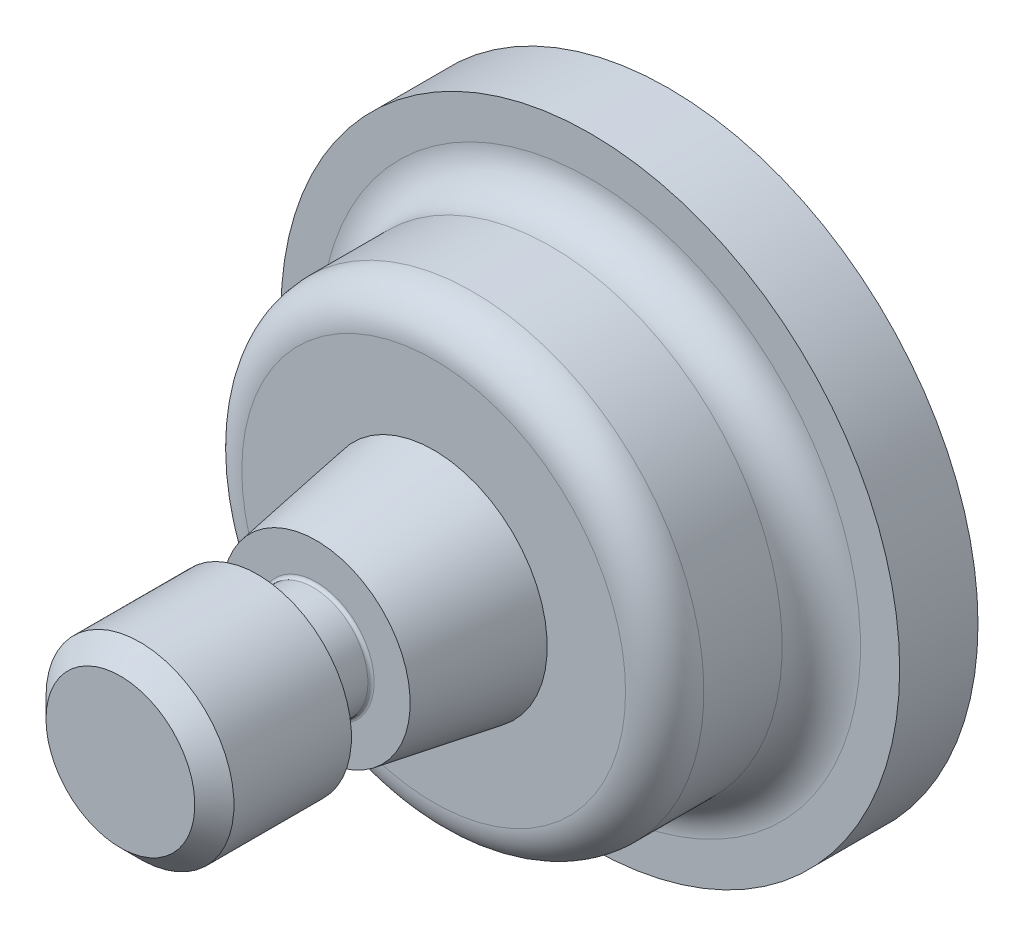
ISO-10303-21;
HEADER;
FILE_DESCRIPTION(('STEP AP214'),'2;1');
FILE_NAME('part.step','',(''),(''),'','','');
FILE_SCHEMA(('AUTOMOTIVE_DESIGN { 1 0 10303 214 1 1 1 1 }'));
ENDSEC;
DATA;
#1=APPLICATION_CONTEXT('core data for automotive mechanical design processes');
#2=APPLICATION_PROTOCOL_DEFINITION('international standard','automotive_design',2000,#1);
#3=PRODUCT_CONTEXT('',#1,'mechanical');
#4=PRODUCT('Part','Part','',(#3));
#5=PRODUCT_RELATED_PRODUCT_CATEGORY('part','',(#4));
#6=PRODUCT_DEFINITION_FORMATION('','',#4);
#7=PRODUCT_DEFINITION_CONTEXT('part definition',#1,'design');
#8=PRODUCT_DEFINITION('design','',#6,#7);
#9=PRODUCT_DEFINITION_SHAPE('','',#8);
#10=(LENGTH_UNIT() NAMED_UNIT(*) SI_UNIT(.MILLI.,.METRE.));
#11=(NAMED_UNIT(*) PLANE_ANGLE_UNIT() SI_UNIT($,.RADIAN.));
#12=(NAMED_UNIT(*) SI_UNIT($,.STERADIAN.) SOLID_ANGLE_UNIT());
#13=UNCERTAINTY_MEASURE_WITH_UNIT(LENGTH_MEASURE(1.E-05),#10,'distance_accuracy_value','');
#14=(GEOMETRIC_REPRESENTATION_CONTEXT(3) GLOBAL_UNCERTAINTY_ASSIGNED_CONTEXT((#13)) GLOBAL_UNIT_ASSIGNED_CONTEXT((#10,
#11,#12)) REPRESENTATION_CONTEXT('',''));
#15=CARTESIAN_POINT('',(0.,0.,0.));
#16=DIRECTION('',(0.,0.,1.));
#17=DIRECTION('',(1.,0.,0.));
#18=AXIS2_PLACEMENT_3D('',#15,#16,#17);
#19=CARTESIAN_POINT('',(0.,50.165,-88.8999841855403));
#20=DIRECTION('',(0.,0.,1.));
#21=DIRECTION('',(1.,0.,0.));
#22=AXIS2_PLACEMENT_3D('',#19,#20,#21);
#23=PLANE('',#22);
#24=CARTESIAN_POINT('',(0.,0.,-88.8999841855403));
#25=DIRECTION('',(0.,0.,-1.));
#26=DIRECTION('',(-1.,0.,0.));
#27=AXIS2_PLACEMENT_3D('',#24,#25,#26);
#28=CIRCLE('',#27,50.165);
#29=CARTESIAN_POINT('',(-50.165,0.,-88.8999841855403));
#30=VERTEX_POINT('',#29);
#31=EDGE_CURVE('E181',#30,#30,#28,.T.);
#32=ORIENTED_EDGE('',*,*,#31,.T.);
#33=EDGE_LOOP('',(#32));
#34=FACE_BOUND('',#33,.T.);
#35=ADVANCED_FACE('F48',(#34),#23,.F.);
#36=CARTESIAN_POINT('',(0.,0.,0.));
#37=DIRECTION('',(0.,0.,-1.));
#38=DIRECTION('',(-1.,0.,0.));
#39=AXIS2_PLACEMENT_3D('',#36,#37,#38);
#40=PLANE('',#39);
#41=CARTESIAN_POINT('',(0.,0.,0.));
#42=DIRECTION('',(0.,0.,-1.));
#43=DIRECTION('',(-1.,0.,0.));
#44=AXIS2_PLACEMENT_3D('',#41,#42,#43);
#45=CIRCLE('',#44,12.0649920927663);
#46=CARTESIAN_POINT('',(-12.0649920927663,0.,0.));
#47=VERTEX_POINT('',#46);
#48=EDGE_CURVE('E11',#47,#47,#45,.T.);
#49=ORIENTED_EDGE('',*,*,#48,.F.);
#50=EDGE_LOOP('',(#49));
#51=FACE_BOUND('',#50,.T.);
#52=ADVANCED_FACE('F239',(#51),#40,.F.);
#53=CARTESIAN_POINT('',(0.,0.,0.));
#54=DIRECTION('',(0.,0.,-1.));
#55=DIRECTION('',(-1.,0.,0.));
#56=AXIS2_PLACEMENT_3D('',#53,#54,#55);
#57=CONICAL_SURFACE('',#56,12.0649920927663,0.785398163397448);
#58=CARTESIAN_POINT('',(0.,0.,-3.17500000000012));
#59=DIRECTION('',(0.,0.,-1.));
#60=DIRECTION('',(-1.,0.,0.));
#61=AXIS2_PLACEMENT_3D('',#58,#59,#60);
#62=CIRCLE('',#61,15.2399920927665);
#63=CARTESIAN_POINT('',(-15.2399920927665,0.,-3.17500000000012));
#64=VERTEX_POINT('',#63);
#65=EDGE_CURVE('E54',#64,#64,#62,.T.);
#66=ORIENTED_EDGE('',*,*,#65,.F.);
#67=EDGE_LOOP('',(#66));
#68=FACE_BOUND('',#67,.T.);
#69=ORIENTED_EDGE('',*,*,#48,.T.);
#70=EDGE_LOOP('',(#69));
#71=FACE_BOUND('',#70,.T.);
#72=ADVANCED_FACE('F235',(#68,#71),#57,.T.);
#73=CARTESIAN_POINT('',(0.,0.,0.));
#74=DIRECTION('',(0.,0.,-1.));
#75=DIRECTION('',(-1.,0.,0.));
#76=AXIS2_PLACEMENT_3D('',#73,#74,#75);
#77=CYLINDRICAL_SURFACE('',#76,15.2399920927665);
#78=CARTESIAN_POINT('',(0.,0.,-22.2250000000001));
#79=DIRECTION('',(0.,0.,-1.));
#80=DIRECTION('',(-1.,0.,0.));
#81=AXIS2_PLACEMENT_3D('',#78,#79,#80);
#82=CIRCLE('',#81,15.2399920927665);
#83=CARTESIAN_POINT('',(-15.2399920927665,0.,-22.2250000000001));
#84=VERTEX_POINT('',#83);
#85=EDGE_CURVE('E58',#84,#84,#82,.T.);
#86=ORIENTED_EDGE('',*,*,#85,.F.);
#87=EDGE_LOOP('',(#86));
#88=FACE_BOUND('',#87,.T.);
#89=ORIENTED_EDGE('',*,*,#65,.T.);
#90=EDGE_LOOP('',(#89));
#91=FACE_BOUND('',#90,.T.);
#92=ADVANCED_FACE('F230',(#88,#91),#77,.T.);
#93=CARTESIAN_POINT('',(0.,15.2399920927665,-22.2250000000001));
#94=DIRECTION('',(0.,0.,1.));
#95=DIRECTION('',(1.,0.,0.));
#96=AXIS2_PLACEMENT_3D('',#93,#94,#95);
#97=PLANE('',#96);
#98=CARTESIAN_POINT('',(0.,0.,-22.2250000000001));
#99=DIRECTION('',(0.,0.,-1.));
#100=DIRECTION('',(-1.,0.,0.));
#101=AXIS2_PLACEMENT_3D('',#98,#99,#100);
#102=CIRCLE('',#101,9.39799209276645);
#103=CARTESIAN_POINT('',(-9.39799209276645,0.,-22.2250000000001));
#104=VERTEX_POINT('',#103);
#105=EDGE_CURVE('E62',#104,#104,#102,.T.);
#106=ORIENTED_EDGE('',*,*,#105,.F.);
#107=EDGE_LOOP('',(#106));
#108=FACE_BOUND('',#107,.T.);
#109=ORIENTED_EDGE('',*,*,#85,.T.);
#110=EDGE_LOOP('',(#109));
#111=FACE_BOUND('',#110,.T.);
#112=ADVANCED_FACE('F222',(#108,#111),#97,.F.);
#113=CARTESIAN_POINT('',(0.,0.,-22.7330000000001));
#114=DIRECTION('',(0.,0.,-1.));
#115=DIRECTION('',(-1.,0.,0.));
#116=AXIS2_PLACEMENT_3D('',#113,#114,#115);
#117=TOROIDAL_SURFACE('',#116,9.39799209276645,0.508000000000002);
#118=CARTESIAN_POINT('',(0.,0.,-22.7330000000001));
#119=DIRECTION('',(0.,0.,-1.));
#120=DIRECTION('',(-1.,0.,0.));
#121=AXIS2_PLACEMENT_3D('',#118,#119,#120);
#122=CIRCLE('',#121,8.88999209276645);
#123=CARTESIAN_POINT('',(-8.88999209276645,0.,-22.7330000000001));
#124=VERTEX_POINT('',#123);
#125=EDGE_CURVE('E93',#124,#124,#122,.T.);
#126=ORIENTED_EDGE('',*,*,#125,.F.);
#127=EDGE_LOOP('',(#126));
#128=FACE_BOUND('',#127,.T.);
#129=ORIENTED_EDGE('',*,*,#105,.T.);
#130=EDGE_LOOP('',(#129));
#131=FACE_BOUND('',#130,.T.);
#132=ADVANCED_FACE('F225',(#128,#131),#117,.F.);
#133=CARTESIAN_POINT('',(0.,0.,0.));
#134=DIRECTION('',(0.,0.,-1.));
#135=DIRECTION('',(-1.,0.,0.));
#136=AXIS2_PLACEMENT_3D('',#133,#134,#135);
#137=CYLINDRICAL_SURFACE('',#136,8.88999209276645);
#138=CARTESIAN_POINT('',(0.,0.,-31.2420000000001));
#139=DIRECTION('',(0.,0.,-1.));
#140=DIRECTION('',(-1.,0.,0.));
#141=AXIS2_PLACEMENT_3D('',#138,#139,#140);
#142=CIRCLE('',#141,8.88999209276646);
#143=CARTESIAN_POINT('',(-8.88999209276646,0.,-31.2420000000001));
#144=VERTEX_POINT('',#143);
#145=EDGE_CURVE('E100',#144,#144,#142,.T.);
#146=ORIENTED_EDGE('',*,*,#145,.F.);
#147=EDGE_LOOP('',(#146));
#148=FACE_BOUND('',#147,.T.);
#149=ORIENTED_EDGE('',*,*,#125,.T.);
#150=EDGE_LOOP('',(#149));
#151=FACE_BOUND('',#150,.T.);
#152=ADVANCED_FACE('F284',(#148,#151),#137,.T.);
#153=CARTESIAN_POINT('',(0.,0.,-31.2420000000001));
#154=DIRECTION('',(0.,0.,-1.));
#155=DIRECTION('',(-1.,0.,0.));
#156=AXIS2_PLACEMENT_3D('',#153,#154,#155);
#157=TOROIDAL_SURFACE('',#156,9.39799209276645,0.508);
#158=CARTESIAN_POINT('',(0.,0.,-31.7500000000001));
#159=DIRECTION('',(0.,0.,-1.));
#160=DIRECTION('',(-1.,0.,0.));
#161=AXIS2_PLACEMENT_3D('',#158,#159,#160);
#162=CIRCLE('',#161,9.39799209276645);
#163=CARTESIAN_POINT('',(-9.39799209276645,0.,-31.7500000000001));
#164=VERTEX_POINT('',#163);
#165=EDGE_CURVE('E113',#164,#164,#162,.T.);
#166=ORIENTED_EDGE('',*,*,#165,.F.);
#167=EDGE_LOOP('',(#166));
#168=FACE_BOUND('',#167,.T.);
#169=ORIENTED_EDGE('',*,*,#145,.T.);
#170=EDGE_LOOP('',(#169));
#171=FACE_BOUND('',#170,.T.);
#172=ADVANCED_FACE('F294',(#168,#171),#157,.F.);
#173=CARTESIAN_POINT('',(0.,15.2399920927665,-31.7500000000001));
#174=DIRECTION('',(0.,0.,-1.));
#175=DIRECTION('',(-1.,0.,0.));
#176=AXIS2_PLACEMENT_3D('',#173,#174,#175);
#177=PLANE('',#176);
#178=CARTESIAN_POINT('',(0.,0.,-31.7500000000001));
#179=DIRECTION('',(0.,0.,-1.));
#180=DIRECTION('',(-1.,0.,0.));
#181=AXIS2_PLACEMENT_3D('',#178,#179,#180);
#182=CIRCLE('',#181,15.2399920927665);
#183=CARTESIAN_POINT('',(-15.2399920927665,0.,-31.7500000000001));
#184=VERTEX_POINT('',#183);
#185=EDGE_CURVE('E117',#184,#184,#182,.T.);
#186=ORIENTED_EDGE('',*,*,#185,.F.);
#187=EDGE_LOOP('',(#186));
#188=FACE_BOUND('',#187,.T.);
#189=ORIENTED_EDGE('',*,*,#165,.T.);
#190=EDGE_LOOP('',(#189));
#191=FACE_BOUND('',#190,.T.);
#192=ADVANCED_FACE('F304',(#188,#191),#177,.F.);
#193=CARTESIAN_POINT('',(0.,0.,-31.7500000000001));
#194=DIRECTION('',(0.,0.,-1.));
#195=DIRECTION('',(-1.,0.,0.));
#196=AXIS2_PLACEMENT_3D('',#193,#194,#195);
#197=CONICAL_SURFACE('',#196,15.2399920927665,0.165148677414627);
#198=CARTESIAN_POINT('',(0.,0.,-50.7987547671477));
#199=DIRECTION('',(0.,0.,-1.));
#200=DIRECTION('',(-1.,0.,0.));
#201=AXIS2_PLACEMENT_3D('',#198,#199,#200);
#202=CIRCLE('',#201,18.4147845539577);
#203=CARTESIAN_POINT('',(-18.4147845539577,0.,-50.7987547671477));
#204=VERTEX_POINT('',#203);
#205=EDGE_CURVE('E132',#204,#204,#202,.T.);
#206=ORIENTED_EDGE('',*,*,#205,.F.);
#207=EDGE_LOOP('',(#206));
#208=FACE_BOUND('',#207,.T.);
#209=ORIENTED_EDGE('',*,*,#185,.T.);
#210=EDGE_LOOP('',(#209));
#211=FACE_BOUND('',#210,.T.);
#212=ADVANCED_FACE('F316',(#208,#211),#197,.T.);
#213=CARTESIAN_POINT('',(0.,31.1149920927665,-50.7987547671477));
#214=DIRECTION('',(0.,0.,-1.));
#215=DIRECTION('',(-1.,0.,0.));
#216=AXIS2_PLACEMENT_3D('',#213,#214,#215);
#217=PLANE('',#216);
#218=CARTESIAN_POINT('',(0.,0.,-50.7987547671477));
#219=DIRECTION('',(0.,0.,-1.));
#220=DIRECTION('',(-1.,0.,0.));
#221=AXIS2_PLACEMENT_3D('',#218,#219,#220);
#222=CIRCLE('',#221,31.1149920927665);
#223=CARTESIAN_POINT('',(-31.1149920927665,0.,-50.7987547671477));
#224=VERTEX_POINT('',#223);
#225=EDGE_CURVE('E137',#224,#224,#222,.T.);
#226=ORIENTED_EDGE('',*,*,#225,.F.);
#227=EDGE_LOOP('',(#226));
#228=FACE_BOUND('',#227,.T.);
#229=ORIENTED_EDGE('',*,*,#205,.T.);
#230=EDGE_LOOP('',(#229));
#231=FACE_BOUND('',#230,.T.);
#232=ADVANCED_FACE('F327',(#228,#231),#217,.F.);
#233=CARTESIAN_POINT('',(0.,0.,-57.1500000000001));
#234=DIRECTION('',(0.,0.,-1.));
#235=DIRECTION('',(-1.,0.,0.));
#236=AXIS2_PLACEMENT_3D('',#233,#234,#235);
#237=TOROIDAL_SURFACE('',#236,31.1149920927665,6.3512452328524);
#238=CARTESIAN_POINT('',(0.,0.,-57.1500000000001));
#239=DIRECTION('',(0.,0.,-1.));
#240=DIRECTION('',(-1.,0.,0.));
#241=AXIS2_PLACEMENT_3D('',#238,#239,#240);
#242=CIRCLE('',#241,37.4662373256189);
#243=CARTESIAN_POINT('',(-37.4662373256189,0.,-57.1500000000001));
#244=VERTEX_POINT('',#243);
#245=EDGE_CURVE('E148',#244,#244,#242,.T.);
#246=ORIENTED_EDGE('',*,*,#245,.F.);
#247=EDGE_LOOP('',(#246));
#248=FACE_BOUND('',#247,.T.);
#249=ORIENTED_EDGE('',*,*,#225,.T.);
#250=EDGE_LOOP('',(#249));
#251=FACE_BOUND('',#250,.T.);
#252=ADVANCED_FACE('F340',(#248,#251),#237,.T.);
#253=CARTESIAN_POINT('',(0.,0.,0.));
#254=DIRECTION('',(0.,0.,-1.));
#255=DIRECTION('',(-1.,0.,0.));
#256=AXIS2_PLACEMENT_3D('',#253,#254,#255);
#257=CYLINDRICAL_SURFACE('',#256,37.4662373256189);
#258=CARTESIAN_POINT('',(0.,0.,-69.8499762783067));
#259=DIRECTION('',(0.,0.,-1.));
#260=DIRECTION('',(-1.,0.,0.));
#261=AXIS2_PLACEMENT_3D('',#258,#259,#260);
#262=CIRCLE('',#261,37.4662373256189);
#263=CARTESIAN_POINT('',(-37.4662373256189,0.,-69.8499762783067));
#264=VERTEX_POINT('',#263);
#265=EDGE_CURVE('E154',#264,#264,#262,.T.);
#266=ORIENTED_EDGE('',*,*,#265,.F.);
#267=EDGE_LOOP('',(#266));
#268=FACE_BOUND('',#267,.T.);
#269=ORIENTED_EDGE('',*,*,#245,.T.);
#270=EDGE_LOOP('',(#269));
#271=FACE_BOUND('',#270,.T.);
#272=ADVANCED_FACE('F208',(#268,#271),#257,.T.);
#273=CARTESIAN_POINT('',(0.,0.,-69.8499762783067));
#274=DIRECTION('',(0.,0.,-1.));
#275=DIRECTION('',(-1.,0.,0.));
#276=AXIS2_PLACEMENT_3D('',#273,#274,#275);
#277=TOROIDAL_SURFACE('',#276,43.815,6.34876267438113);
#278=CARTESIAN_POINT('',(0.,0.,-76.1987389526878));
#279=DIRECTION('',(0.,0.,-1.));
#280=DIRECTION('',(-1.,0.,0.));
#281=AXIS2_PLACEMENT_3D('',#278,#279,#280);
#282=CIRCLE('',#281,43.815);
#283=CARTESIAN_POINT('',(-43.815,0.,-76.1987389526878));
#284=VERTEX_POINT('',#283);
#285=EDGE_CURVE('E168',#284,#284,#282,.T.);
#286=ORIENTED_EDGE('',*,*,#285,.F.);
#287=EDGE_LOOP('',(#286));
#288=FACE_BOUND('',#287,.T.);
#289=ORIENTED_EDGE('',*,*,#265,.T.);
#290=EDGE_LOOP('',(#289));
#291=FACE_BOUND('',#290,.T.);
#292=ADVANCED_FACE('F197',(#288,#291),#277,.F.);
#293=CARTESIAN_POINT('',(0.,50.165,-76.1987389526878));
#294=DIRECTION('',(0.,0.,-1.));
#295=DIRECTION('',(-1.,0.,0.));
#296=AXIS2_PLACEMENT_3D('',#293,#294,#295);
#297=PLANE('',#296);
#298=CARTESIAN_POINT('',(0.,0.,-76.1987389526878));
#299=DIRECTION('',(0.,0.,-1.));
#300=DIRECTION('',(-1.,0.,0.));
#301=AXIS2_PLACEMENT_3D('',#298,#299,#300);
#302=CIRCLE('',#301,50.165);
#303=CARTESIAN_POINT('',(-50.165,0.,-76.1987389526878));
#304=VERTEX_POINT('',#303);
#305=EDGE_CURVE('E173',#304,#304,#302,.T.);
#306=ORIENTED_EDGE('',*,*,#305,.F.);
#307=EDGE_LOOP('',(#306));
#308=FACE_BOUND('',#307,.T.);
#309=ORIENTED_EDGE('',*,*,#285,.T.);
#310=EDGE_LOOP('',(#309));
#311=FACE_BOUND('',#310,.T.);
#312=ADVANCED_FACE('F200',(#308,#311),#297,.F.);
#313=CARTESIAN_POINT('',(0.,0.,0.));
#314=DIRECTION('',(0.,0.,-1.));
#315=DIRECTION('',(-1.,0.,0.));
#316=AXIS2_PLACEMENT_3D('',#313,#314,#315);
#317=CYLINDRICAL_SURFACE('',#316,50.165);
#318=ORIENTED_EDGE('',*,*,#31,.F.);
#319=EDGE_LOOP('',(#318));
#320=FACE_BOUND('',#319,.T.);
#321=ORIENTED_EDGE('',*,*,#305,.T.);
#322=EDGE_LOOP('',(#321));
#323=FACE_BOUND('',#322,.T.);
#324=ADVANCED_FACE('F193',(#320,#323),#317,.T.);
#325=CLOSED_SHELL('',(#35,#52,#72,#92,#112,#132,#152,#172,#192,#212,#232,#252,#272,#292,#312,#324));
#326=MANIFOLD_SOLID_BREP('B2',#325);
#327=ADVANCED_BREP_SHAPE_REPRESENTATION('',(#18,#326),#14);
#328=SHAPE_DEFINITION_REPRESENTATION(#9,#327);
ENDSEC;
END-ISO-10303-21;
